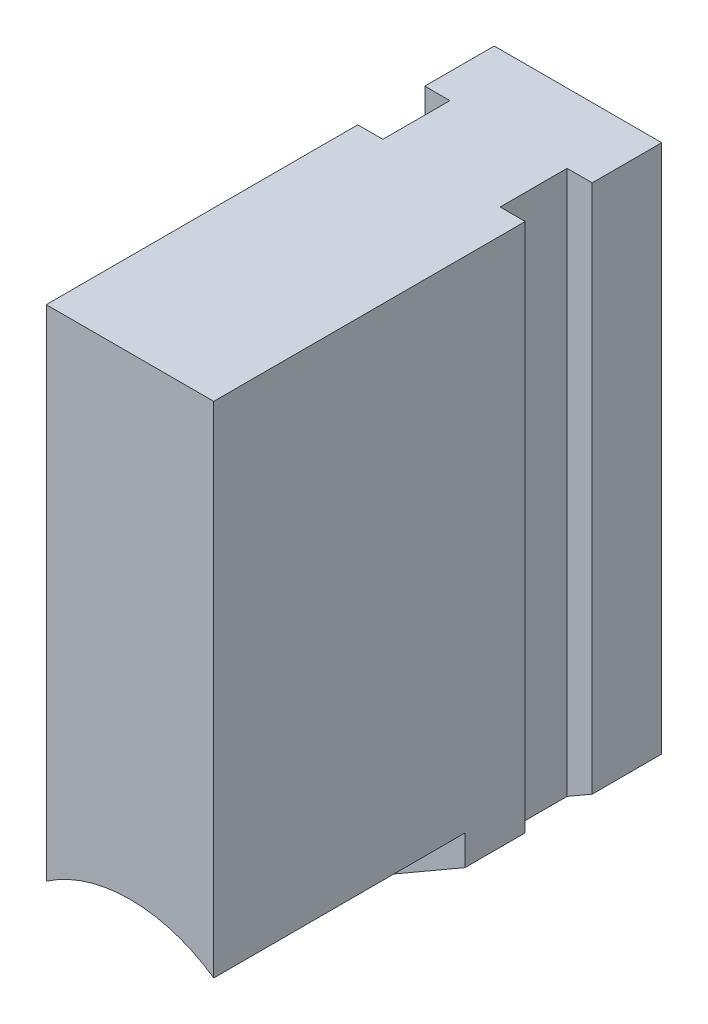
from build123d import *

# Parameters (mm, degrees)
BASE_EXTRUSION_DEPTH      = 32.5
BASE_EXTRUSION_DEPTH_BACK = 21
ESQUISSE2_W               = 10
ESQUISSE2_H               = 8
ENL_V_MAT_EXTRU_3_DEPTH   = 77.923663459
ESQUISSE3_R               = 17.5
ENL_V_MAT_EXTRU_4_DEPTH   = 30


with BuildPart() as part:
    # Esquisse1 → Base-Extrusion (new, two sides: drawn at the far end of the back side and taken through both)
    with BuildSketch(Plane.XY.offset(-BASE_EXTRUSION_DEPTH_BACK)):
        Polygon((0, 0), (10, 5.773502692), (10, 69), (-10, 69), (-10, 5.773502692), align=None)
    extrude(amount=BASE_EXTRUSION_DEPTH + BASE_EXTRUSION_DEPTH_BACK)

    # Esquisse2 → Enl_v. mat.-Extru.3 (cut, through all)
    with BuildSketch(Plane(origin=(0, 0, 0), x_dir=(1, 0, 0), z_dir=(0, 1, 0))):
        with Locations((-12, 8.7)):
            Rectangle(ESQUISSE2_W, ESQUISSE2_H)
        with Locations((12, 8.7)):
            Rectangle(ESQUISSE2_W, ESQUISSE2_H)
    extrude(amount=ENL_V_MAT_EXTRU_3_DEPTH, mode=Mode.SUBTRACT)

    # Esquisse3 → Enl_v. mat.-Extru.4 (cut)
    with BuildSketch(Plane.XY.offset(32.5)):
        with Locations((0, -5)):
            Circle(ESQUISSE3_R)
    extrude(amount=-ENL_V_MAT_EXTRU_4_DEPTH, mode=Mode.SUBTRACT)


solid = part.part
